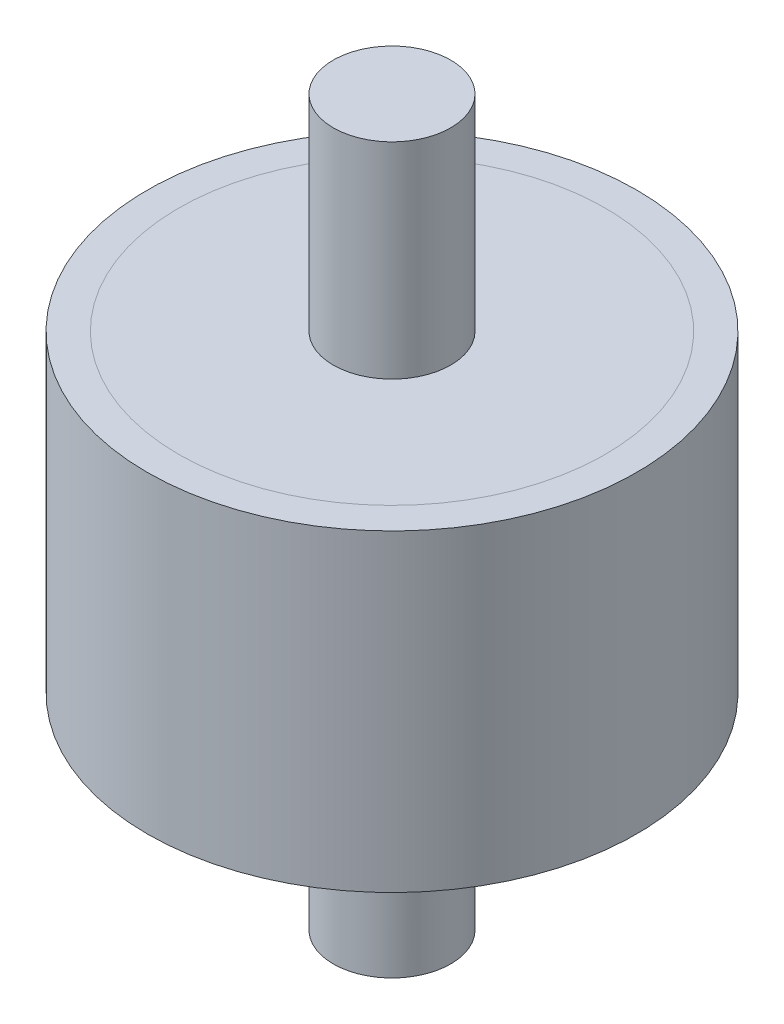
ISO-10303-21;
HEADER;
FILE_DESCRIPTION(('STEP AP214'),'2;1');
FILE_NAME('part.step','',(''),(''),'','','');
FILE_SCHEMA(('AUTOMOTIVE_DESIGN { 1 0 10303 214 1 1 1 1 }'));
ENDSEC;
DATA;
#1=APPLICATION_CONTEXT('core data for automotive mechanical design processes');
#2=APPLICATION_PROTOCOL_DEFINITION('international standard','automotive_design',2000,#1);
#3=PRODUCT_CONTEXT('',#1,'mechanical');
#4=PRODUCT('Part','Part','',(#3));
#5=PRODUCT_RELATED_PRODUCT_CATEGORY('part','',(#4));
#6=PRODUCT_DEFINITION_FORMATION('','',#4);
#7=PRODUCT_DEFINITION_CONTEXT('part definition',#1,'design');
#8=PRODUCT_DEFINITION('design','',#6,#7);
#9=PRODUCT_DEFINITION_SHAPE('','',#8);
#10=(LENGTH_UNIT() NAMED_UNIT(*) SI_UNIT(.MILLI.,.METRE.));
#11=(NAMED_UNIT(*) PLANE_ANGLE_UNIT() SI_UNIT($,.RADIAN.));
#12=(NAMED_UNIT(*) SI_UNIT($,.STERADIAN.) SOLID_ANGLE_UNIT());
#13=UNCERTAINTY_MEASURE_WITH_UNIT(LENGTH_MEASURE(1.E-05),#10,'distance_accuracy_value','');
#14=(GEOMETRIC_REPRESENTATION_CONTEXT(3) GLOBAL_UNCERTAINTY_ASSIGNED_CONTEXT((#13)) GLOBAL_UNIT_ASSIGNED_CONTEXT((#10,
#11,#12)) REPRESENTATION_CONTEXT('',''));
#15=CARTESIAN_POINT('',(0.,0.,0.));
#16=DIRECTION('',(0.,0.,1.));
#17=DIRECTION('',(1.,0.,0.));
#18=AXIS2_PLACEMENT_3D('',#15,#16,#17);
#19=CARTESIAN_POINT('',(-19.84375,-12.7,0.));
#20=DIRECTION('',(0.,-1.,0.));
#21=DIRECTION('',(0.,0.,-1.));
#22=AXIS2_PLACEMENT_3D('',#19,#20,#21);
#23=PLANE('',#22);
#24=CARTESIAN_POINT('',(0.,-12.7,0.));
#25=DIRECTION('',(0.,1.,0.));
#26=DIRECTION('',(0.,0.,1.));
#27=AXIS2_PLACEMENT_3D('',#24,#25,#26);
#28=CIRCLE('',#27,19.84375);
#29=CARTESIAN_POINT('',(0.,-12.7,19.84375));
#30=VERTEX_POINT('',#29);
#31=EDGE_CURVE('E54',#30,#30,#28,.T.);
#32=ORIENTED_EDGE('',*,*,#31,.F.);
#33=EDGE_LOOP('',(#32));
#34=FACE_BOUND('',#33,.T.);
#35=CARTESIAN_POINT('',(0.,-12.7,0.));
#36=DIRECTION('',(0.,-1.,0.));
#37=DIRECTION('',(0.,0.,-1.));
#38=AXIS2_PLACEMENT_3D('',#35,#36,#37);
#39=CIRCLE('',#38,17.30375);
#40=CARTESIAN_POINT('',(0.,-12.7,-17.30375));
#41=VERTEX_POINT('',#40);
#42=EDGE_CURVE('E43',#41,#41,#39,.F.);
#43=ORIENTED_EDGE('',*,*,#42,.T.);
#44=EDGE_LOOP('',(#43));
#45=FACE_BOUND('',#44,.T.);
#46=ADVANCED_FACE('F32',(#34,#45),#23,.T.);
#47=CARTESIAN_POINT('',(-19.84375,12.7,0.));
#48=DIRECTION('',(0.,1.,0.));
#49=DIRECTION('',(0.,0.,1.));
#50=AXIS2_PLACEMENT_3D('',#47,#48,#49);
#51=PLANE('',#50);
#52=CARTESIAN_POINT('',(0.,12.7,0.));
#53=DIRECTION('',(0.,1.,0.));
#54=DIRECTION('',(0.,0.,1.));
#55=AXIS2_PLACEMENT_3D('',#52,#53,#54);
#56=CIRCLE('',#55,19.84375);
#57=CARTESIAN_POINT('',(0.,12.7,19.84375));
#58=VERTEX_POINT('',#57);
#59=EDGE_CURVE('E57',#58,#58,#56,.T.);
#60=ORIENTED_EDGE('',*,*,#59,.T.);
#61=EDGE_LOOP('',(#60));
#62=FACE_BOUND('',#61,.T.);
#63=CARTESIAN_POINT('',(0.,12.7,0.));
#64=DIRECTION('',(0.,1.,0.));
#65=DIRECTION('',(0.,0.,1.));
#66=AXIS2_PLACEMENT_3D('',#63,#64,#65);
#67=CIRCLE('',#66,17.30375);
#68=CARTESIAN_POINT('',(0.,12.7,17.30375));
#69=VERTEX_POINT('',#68);
#70=EDGE_CURVE('E48',#69,#69,#67,.F.);
#71=ORIENTED_EDGE('',*,*,#70,.T.);
#72=EDGE_LOOP('',(#71));
#73=FACE_BOUND('',#72,.T.);
#74=ADVANCED_FACE('F78',(#62,#73),#51,.T.);
#75=CARTESIAN_POINT('',(0.,83.5243386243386,0.));
#76=DIRECTION('',(0.,1.,0.));
#77=DIRECTION('',(0.,0.,1.));
#78=AXIS2_PLACEMENT_3D('',#75,#76,#77);
#79=CYLINDRICAL_SURFACE('',#78,19.84375);
#80=ORIENTED_EDGE('',*,*,#31,.T.);
#81=EDGE_LOOP('',(#80));
#82=FACE_BOUND('',#81,.T.);
#83=ORIENTED_EDGE('',*,*,#59,.F.);
#84=EDGE_LOOP('',(#83));
#85=FACE_BOUND('',#84,.T.);
#86=ADVANCED_FACE('F34',(#82,#85),#79,.T.);
#87=CARTESIAN_POINT('',(0.,-12.7,0.));
#88=DIRECTION('',(0.,-1.,0.));
#89=DIRECTION('',(0.,0.,-1.));
#90=AXIS2_PLACEMENT_3D('',#87,#88,#89);
#91=CIRCLE('',#90,4.7625);
#92=CARTESIAN_POINT('',(0.,-12.7,-4.7625));
#93=VERTEX_POINT('',#92);
#94=EDGE_CURVE('E10',#93,#93,#91,.T.);
#95=ORIENTED_EDGE('',*,*,#94,.F.);
#96=EDGE_LOOP('',(#95));
#97=FACE_BOUND('',#96,.T.);
#98=ORIENTED_EDGE('',*,*,#42,.F.);
#99=EDGE_LOOP('',(#98));
#100=FACE_BOUND('',#99,.T.);
#101=ADVANCED_FACE('F80',(#97,#100),#23,.T.);
#102=CARTESIAN_POINT('',(0.,12.7,0.));
#103=DIRECTION('',(0.,1.,0.));
#104=DIRECTION('',(0.,0.,1.));
#105=AXIS2_PLACEMENT_3D('',#102,#103,#104);
#106=CIRCLE('',#105,4.7625);
#107=CARTESIAN_POINT('',(0.,12.7,4.7625));
#108=VERTEX_POINT('',#107);
#109=EDGE_CURVE('E39',#108,#108,#106,.T.);
#110=ORIENTED_EDGE('',*,*,#109,.F.);
#111=EDGE_LOOP('',(#110));
#112=FACE_BOUND('',#111,.T.);
#113=ORIENTED_EDGE('',*,*,#70,.F.);
#114=EDGE_LOOP('',(#113));
#115=FACE_BOUND('',#114,.T.);
#116=ADVANCED_FACE('F86',(#112,#115),#51,.T.);
#117=CARTESIAN_POINT('',(0.,29.36875,0.));
#118=DIRECTION('',(0.,1.,0.));
#119=DIRECTION('',(0.,0.,1.));
#120=AXIS2_PLACEMENT_3D('',#117,#118,#119);
#121=PLANE('',#120);
#122=CARTESIAN_POINT('',(0.,29.36875,0.));
#123=DIRECTION('',(0.,1.,0.));
#124=DIRECTION('',(0.,0.,1.));
#125=AXIS2_PLACEMENT_3D('',#122,#123,#124);
#126=CIRCLE('',#125,4.7625);
#127=CARTESIAN_POINT('',(0.,29.36875,4.7625));
#128=VERTEX_POINT('',#127);
#129=EDGE_CURVE('E60',#128,#128,#126,.T.);
#130=ORIENTED_EDGE('',*,*,#129,.T.);
#131=EDGE_LOOP('',(#130));
#132=FACE_BOUND('',#131,.T.);
#133=ADVANCED_FACE('F95',(#132),#121,.T.);
#134=CARTESIAN_POINT('',(0.,26.3093719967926,0.));
#135=DIRECTION('',(0.,1.,0.));
#136=DIRECTION('',(0.,0.,1.));
#137=AXIS2_PLACEMENT_3D('',#134,#135,#136);
#138=CYLINDRICAL_SURFACE('',#137,4.7625);
#139=ORIENTED_EDGE('',*,*,#109,.T.);
#140=EDGE_LOOP('',(#139));
#141=FACE_BOUND('',#140,.T.);
#142=ORIENTED_EDGE('',*,*,#129,.F.);
#143=EDGE_LOOP('',(#142));
#144=FACE_BOUND('',#143,.T.);
#145=ADVANCED_FACE('F75',(#141,#144),#138,.T.);
#146=CARTESIAN_POINT('',(0.,26.3093719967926,0.));
#147=DIRECTION('',(0.,1.,0.));
#148=DIRECTION('',(0.,0.,1.));
#149=AXIS2_PLACEMENT_3D('',#146,#147,#148);
#150=CYLINDRICAL_SURFACE('',#149,4.7625);
#151=CARTESIAN_POINT('',(0.,-29.36875,0.));
#152=DIRECTION('',(0.,1.,0.));
#153=DIRECTION('',(0.,0.,1.));
#154=AXIS2_PLACEMENT_3D('',#151,#152,#153);
#155=CIRCLE('',#154,4.7625);
#156=CARTESIAN_POINT('',(0.,-29.36875,4.7625));
#157=VERTEX_POINT('',#156);
#158=EDGE_CURVE('E63',#157,#157,#155,.T.);
#159=ORIENTED_EDGE('',*,*,#158,.T.);
#160=EDGE_LOOP('',(#159));
#161=FACE_BOUND('',#160,.T.);
#162=ORIENTED_EDGE('',*,*,#94,.T.);
#163=EDGE_LOOP('',(#162));
#164=FACE_BOUND('',#163,.T.);
#165=ADVANCED_FACE('F67',(#161,#164),#150,.T.);
#166=CARTESIAN_POINT('',(0.,-29.36875,0.));
#167=DIRECTION('',(0.,-1.,0.));
#168=DIRECTION('',(0.,0.,-1.));
#169=AXIS2_PLACEMENT_3D('',#166,#167,#168);
#170=PLANE('',#169);
#171=ORIENTED_EDGE('',*,*,#158,.F.);
#172=EDGE_LOOP('',(#171));
#173=FACE_BOUND('',#172,.T.);
#174=ADVANCED_FACE('F69',(#173),#170,.T.);
#175=CLOSED_SHELL('',(#46,#74,#86,#101,#116,#133,#145,#165,#174));
#176=MANIFOLD_SOLID_BREP('B2',#175);
#177=ADVANCED_BREP_SHAPE_REPRESENTATION('',(#18,#176),#14);
#178=SHAPE_DEFINITION_REPRESENTATION(#9,#177);
ENDSEC;
END-ISO-10303-21;
